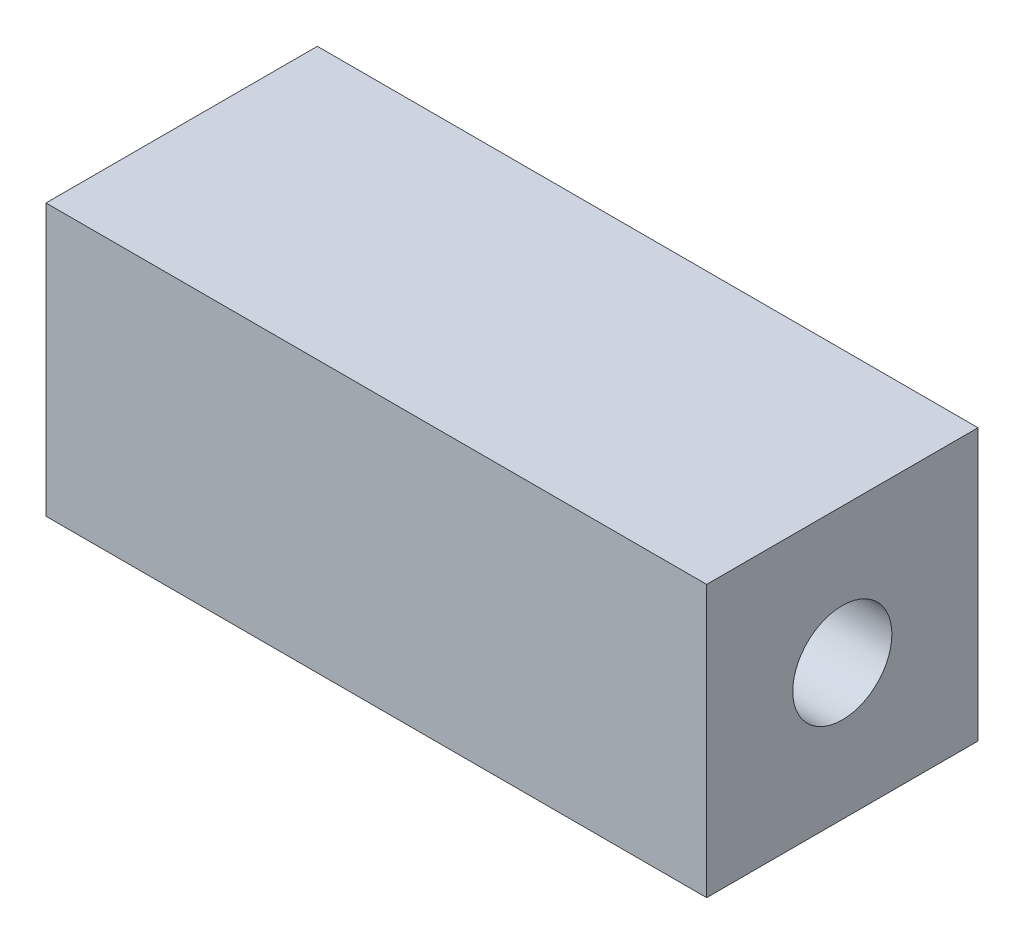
ISO-10303-21;
HEADER;
FILE_DESCRIPTION(('STEP AP214'),'2;1');
FILE_NAME('part.step','',(''),(''),'','','');
FILE_SCHEMA(('AUTOMOTIVE_DESIGN { 1 0 10303 214 1 1 1 1 }'));
ENDSEC;
DATA;
#1=APPLICATION_CONTEXT('core data for automotive mechanical design processes');
#2=APPLICATION_PROTOCOL_DEFINITION('international standard','automotive_design',2000,#1);
#3=PRODUCT_CONTEXT('',#1,'mechanical');
#4=PRODUCT('Part','Part','',(#3));
#5=PRODUCT_RELATED_PRODUCT_CATEGORY('part','',(#4));
#6=PRODUCT_DEFINITION_FORMATION('','',#4);
#7=PRODUCT_DEFINITION_CONTEXT('part definition',#1,'design');
#8=PRODUCT_DEFINITION('design','',#6,#7);
#9=PRODUCT_DEFINITION_SHAPE('','',#8);
#10=(LENGTH_UNIT() NAMED_UNIT(*) SI_UNIT(.MILLI.,.METRE.));
#11=(NAMED_UNIT(*) PLANE_ANGLE_UNIT() SI_UNIT($,.RADIAN.));
#12=(NAMED_UNIT(*) SI_UNIT($,.STERADIAN.) SOLID_ANGLE_UNIT());
#13=UNCERTAINTY_MEASURE_WITH_UNIT(LENGTH_MEASURE(1.E-05),#10,'distance_accuracy_value','');
#14=(GEOMETRIC_REPRESENTATION_CONTEXT(3) GLOBAL_UNCERTAINTY_ASSIGNED_CONTEXT((#13)) GLOBAL_UNIT_ASSIGNED_CONTEXT((#10,
#11,#12)) REPRESENTATION_CONTEXT('',''));
#15=CARTESIAN_POINT('',(0.,0.,0.));
#16=DIRECTION('',(0.,0.,1.));
#17=DIRECTION('',(1.,0.,0.));
#18=AXIS2_PLACEMENT_3D('',#15,#16,#17);
#19=CARTESIAN_POINT('',(0.,0.,0.));
#20=DIRECTION('',(1.,0.,0.));
#21=DIRECTION('',(0.,0.,-1.));
#22=AXIS2_PLACEMENT_3D('',#19,#20,#21);
#23=PLANE('',#22);
#24=DIRECTION('',(0.,-1.,0.));
#25=VECTOR('',#24,1.);
#26=CARTESIAN_POINT('',(0.,4.68518518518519,11.9614197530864));
#27=LINE('',#26,#25);
#28=CARTESIAN_POINT('',(0.,4.68518518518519,11.9614197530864));
#29=VERTEX_POINT('',#28);
#30=CARTESIAN_POINT('',(0.,-6.81481481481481,11.9614197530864));
#31=VERTEX_POINT('',#30);
#32=EDGE_CURVE('E180',#29,#31,#27,.T.);
#33=ORIENTED_EDGE('',*,*,#32,.F.);
#34=DIRECTION('',(0.,0.,1.));
#35=VECTOR('',#34,1.);
#36=CARTESIAN_POINT('',(0.,4.68518518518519,11.9614197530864));
#37=LINE('',#36,#35);
#38=CARTESIAN_POINT('',(0.,4.68518518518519,0.461419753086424));
#39=VERTEX_POINT('',#38);
#40=EDGE_CURVE('E80',#39,#29,#37,.T.);
#41=ORIENTED_EDGE('',*,*,#40,.F.);
#42=DIRECTION('',(0.,1.,0.));
#43=VECTOR('',#42,1.);
#44=CARTESIAN_POINT('',(0.,4.68518518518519,0.461419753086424));
#45=LINE('',#44,#43);
#46=CARTESIAN_POINT('',(0.,-6.81481481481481,0.461419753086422));
#47=VERTEX_POINT('',#46);
#48=EDGE_CURVE('E192',#47,#39,#45,.T.);
#49=ORIENTED_EDGE('',*,*,#48,.F.);
#50=DIRECTION('',(0.,0.,-1.));
#51=VECTOR('',#50,1.);
#52=CARTESIAN_POINT('',(0.,-6.81481481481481,11.9614197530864));
#53=LINE('',#52,#51);
#54=EDGE_CURVE('E190',#31,#47,#53,.T.);
#55=ORIENTED_EDGE('',*,*,#54,.F.);
#56=EDGE_LOOP('',(#33,#41,#49,#55));
#57=FACE_BOUND('',#56,.T.);
#58=DIRECTION('',(0.,0.396504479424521,0.918032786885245));
#59=VECTOR('',#58,1.);
#60=CARTESIAN_POINT('',(0.,0.0193533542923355,-0.00835884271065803));
#61=LINE('',#60,#59);
#62=CARTESIAN_POINT('',(0.,1.21068435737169,2.74994775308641));
#63=VERTEX_POINT('',#62);
#64=CARTESIAN_POINT('',(0.,2.7057171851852,6.21141975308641));
#65=VERTEX_POINT('',#64);
#66=EDGE_CURVE('E50',#63,#65,#61,.T.);
#67=ORIENTED_EDGE('',*,*,#66,.T.);
#68=DIRECTION('',(0.,-0.396504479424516,0.918032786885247));
#69=VECTOR('',#68,1.);
#70=CARTESIAN_POINT('',(0.,4.54131802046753,1.96142552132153));
#71=LINE('',#70,#69);
#72=CARTESIAN_POINT('',(0.,1.21068435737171,9.67289175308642));
#73=VERTEX_POINT('',#72);
#74=EDGE_CURVE('E165',#65,#73,#71,.T.);
#75=ORIENTED_EDGE('',*,*,#74,.T.);
#76=DIRECTION('',(0.,-1.,0.));
#77=VECTOR('',#76,1.);
#78=CARTESIAN_POINT('',(0.,0.,9.67289175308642));
#79=LINE('',#78,#77);
#80=CARTESIAN_POINT('',(0.,-3.34031398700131,9.67289175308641));
#81=VERTEX_POINT('',#80);
#82=EDGE_CURVE('E162',#73,#81,#79,.T.);
#83=ORIENTED_EDGE('',*,*,#82,.T.);
#84=DIRECTION('',(0.,0.396504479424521,0.918032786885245));
#85=VECTOR('',#84,1.);
#86=CARTESIAN_POINT('',(0.,-6.33613621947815,2.73661946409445));
#87=LINE('',#86,#85);
#88=CARTESIAN_POINT('',(0.,-4.83534681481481,6.21141975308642));
#89=VERTEX_POINT('',#88);
#90=EDGE_CURVE('E159',#89,#81,#87,.T.);
#91=ORIENTED_EDGE('',*,*,#90,.F.);
#92=DIRECTION('',(0.,-0.396504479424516,0.918032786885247));
#93=VECTOR('',#92,1.);
#94=CARTESIAN_POINT('',(0.,-1.81417155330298,-0.783552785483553));
#95=LINE('',#94,#93);
#96=CARTESIAN_POINT('',(0.,-3.34031398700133,2.7499477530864));
#97=VERTEX_POINT('',#96);
#98=EDGE_CURVE('E156',#97,#89,#95,.T.);
#99=ORIENTED_EDGE('',*,*,#98,.F.);
#100=DIRECTION('',(0.,-1.,0.));
#101=VECTOR('',#100,1.);
#102=CARTESIAN_POINT('',(0.,0.,2.74994775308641));
#103=LINE('',#102,#101);
#104=EDGE_CURVE('E154',#63,#97,#103,.T.);
#105=ORIENTED_EDGE('',*,*,#104,.F.);
#106=EDGE_LOOP('',(#67,#75,#83,#91,#99,#105));
#107=FACE_BOUND('',#106,.T.);
#108=ADVANCED_FACE('F35',(#57,#107),#23,.F.);
#109=CARTESIAN_POINT('',(28.,-1.06481481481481,6.21141975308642));
#110=DIRECTION('',(-1.,0.,0.));
#111=DIRECTION('',(0.,0.,1.));
#112=AXIS2_PLACEMENT_3D('',#109,#110,#111);
#113=CYLINDRICAL_SURFACE('',#112,2.1);
#114=CARTESIAN_POINT('',(28.,-1.06481481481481,6.21141975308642));
#115=DIRECTION('',(1.,0.,0.));
#116=DIRECTION('',(0.,0.,-1.));
#117=AXIS2_PLACEMENT_3D('',#114,#115,#116);
#118=CIRCLE('',#117,2.1);
#119=CARTESIAN_POINT('',(28.,-1.06481481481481,4.11141975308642));
#120=VERTEX_POINT('',#119);
#121=EDGE_CURVE('E170',#120,#120,#118,.T.);
#122=ORIENTED_EDGE('',*,*,#121,.T.);
#123=EDGE_LOOP('',(#122));
#124=FACE_BOUND('',#123,.T.);
#125=CARTESIAN_POINT('',(3.5,-1.06481481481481,6.21141975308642));
#126=DIRECTION('',(-1.,0.,0.));
#127=DIRECTION('',(0.,0.,1.));
#128=AXIS2_PLACEMENT_3D('',#125,#126,#127);
#129=CIRCLE('',#128,2.1);
#130=CARTESIAN_POINT('',(3.5,-1.06481481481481,8.31141975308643));
#131=VERTEX_POINT('',#130);
#132=EDGE_CURVE('E138',#131,#131,#129,.F.);
#133=ORIENTED_EDGE('',*,*,#132,.F.);
#134=EDGE_LOOP('',(#133));
#135=FACE_BOUND('',#134,.T.);
#136=ADVANCED_FACE('F222',(#124,#135),#113,.F.);
#137=CARTESIAN_POINT('',(28.,0.,0.));
#138=DIRECTION('',(1.,0.,0.));
#139=DIRECTION('',(0.,0.,-1.));
#140=AXIS2_PLACEMENT_3D('',#137,#138,#139);
#141=PLANE('',#140);
#142=DIRECTION('',(0.,-1.,0.));
#143=VECTOR('',#142,1.);
#144=CARTESIAN_POINT('',(28.,4.68518518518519,11.9614197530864));
#145=LINE('',#144,#143);
#146=CARTESIAN_POINT('',(28.,4.68518518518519,11.9614197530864));
#147=VERTEX_POINT('',#146);
#148=CARTESIAN_POINT('',(28.,-6.81481481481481,11.9614197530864));
#149=VERTEX_POINT('',#148);
#150=EDGE_CURVE('E181',#147,#149,#145,.T.);
#151=ORIENTED_EDGE('',*,*,#150,.T.);
#152=DIRECTION('',(0.,0.,-1.));
#153=VECTOR('',#152,1.);
#154=CARTESIAN_POINT('',(28.,-6.81481481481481,11.9614197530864));
#155=LINE('',#154,#153);
#156=CARTESIAN_POINT('',(28.,-6.81481481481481,0.461419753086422));
#157=VERTEX_POINT('',#156);
#158=EDGE_CURVE('E87',#149,#157,#155,.T.);
#159=ORIENTED_EDGE('',*,*,#158,.T.);
#160=DIRECTION('',(0.,1.,0.));
#161=VECTOR('',#160,1.);
#162=CARTESIAN_POINT('',(28.,4.68518518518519,0.461419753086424));
#163=LINE('',#162,#161);
#164=CARTESIAN_POINT('',(28.,4.68518518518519,0.461419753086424));
#165=VERTEX_POINT('',#164);
#166=EDGE_CURVE('E184',#157,#165,#163,.T.);
#167=ORIENTED_EDGE('',*,*,#166,.T.);
#168=DIRECTION('',(0.,0.,1.));
#169=VECTOR('',#168,1.);
#170=CARTESIAN_POINT('',(28.,4.68518518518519,11.9614197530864));
#171=LINE('',#170,#169);
#172=EDGE_CURVE('E59',#165,#147,#171,.T.);
#173=ORIENTED_EDGE('',*,*,#172,.T.);
#174=EDGE_LOOP('',(#151,#159,#167,#173));
#175=FACE_BOUND('',#174,.T.);
#176=ORIENTED_EDGE('',*,*,#121,.F.);
#177=EDGE_LOOP('',(#176));
#178=FACE_BOUND('',#177,.T.);
#179=ADVANCED_FACE('F226',(#175,#178),#141,.T.);
#180=CARTESIAN_POINT('',(28.,4.68518518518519,11.9614197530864));
#181=DIRECTION('',(0.,0.,-1.));
#182=DIRECTION('',(-1.,0.,0.));
#183=AXIS2_PLACEMENT_3D('',#180,#181,#182);
#184=PLANE('',#183);
#185=ORIENTED_EDGE('',*,*,#32,.T.);
#186=DIRECTION('',(-1.,0.,0.));
#187=VECTOR('',#186,1.);
#188=CARTESIAN_POINT('',(28.,-6.81481481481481,11.9614197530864));
#189=LINE('',#188,#187);
#190=EDGE_CURVE('E11',#149,#31,#189,.T.);
#191=ORIENTED_EDGE('',*,*,#190,.F.);
#192=ORIENTED_EDGE('',*,*,#150,.F.);
#193=DIRECTION('',(-1.,0.,0.));
#194=VECTOR('',#193,1.);
#195=CARTESIAN_POINT('',(28.,4.68518518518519,11.9614197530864));
#196=LINE('',#195,#194);
#197=EDGE_CURVE('E187',#147,#29,#196,.T.);
#198=ORIENTED_EDGE('',*,*,#197,.T.);
#199=EDGE_LOOP('',(#185,#191,#192,#198));
#200=FACE_BOUND('',#199,.T.);
#201=ADVANCED_FACE('F37',(#200),#184,.F.);
#202=CARTESIAN_POINT('',(28.,-6.81481481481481,11.9614197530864));
#203=DIRECTION('',(0.,1.,0.));
#204=DIRECTION('',(0.,0.,1.));
#205=AXIS2_PLACEMENT_3D('',#202,#203,#204);
#206=PLANE('',#205);
#207=ORIENTED_EDGE('',*,*,#54,.T.);
#208=DIRECTION('',(-1.,0.,0.));
#209=VECTOR('',#208,1.);
#210=CARTESIAN_POINT('',(28.,-6.81481481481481,0.461419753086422));
#211=LINE('',#210,#209);
#212=EDGE_CURVE('E43',#157,#47,#211,.T.);
#213=ORIENTED_EDGE('',*,*,#212,.F.);
#214=ORIENTED_EDGE('',*,*,#158,.F.);
#215=ORIENTED_EDGE('',*,*,#190,.T.);
#216=EDGE_LOOP('',(#207,#213,#214,#215));
#217=FACE_BOUND('',#216,.T.);
#218=ADVANCED_FACE('F218',(#217),#206,.F.);
#219=CARTESIAN_POINT('',(28.,4.68518518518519,0.461419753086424));
#220=DIRECTION('',(0.,0.,1.));
#221=DIRECTION('',(0.,-1.,0.));
#222=AXIS2_PLACEMENT_3D('',#219,#220,#221);
#223=PLANE('',#222);
#224=ORIENTED_EDGE('',*,*,#48,.T.);
#225=DIRECTION('',(-1.,0.,0.));
#226=VECTOR('',#225,1.);
#227=CARTESIAN_POINT('',(28.,4.68518518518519,0.461419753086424));
#228=LINE('',#227,#226);
#229=EDGE_CURVE('E196',#165,#39,#228,.T.);
#230=ORIENTED_EDGE('',*,*,#229,.F.);
#231=ORIENTED_EDGE('',*,*,#166,.F.);
#232=ORIENTED_EDGE('',*,*,#212,.T.);
#233=EDGE_LOOP('',(#224,#230,#231,#232));
#234=FACE_BOUND('',#233,.T.);
#235=ADVANCED_FACE('F201',(#234),#223,.F.);
#236=CARTESIAN_POINT('',(28.,4.68518518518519,11.9614197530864));
#237=DIRECTION('',(0.,-1.,0.));
#238=DIRECTION('',(0.,0.,-1.));
#239=AXIS2_PLACEMENT_3D('',#236,#237,#238);
#240=PLANE('',#239);
#241=ORIENTED_EDGE('',*,*,#40,.T.);
#242=ORIENTED_EDGE('',*,*,#197,.F.);
#243=ORIENTED_EDGE('',*,*,#172,.F.);
#244=ORIENTED_EDGE('',*,*,#229,.T.);
#245=EDGE_LOOP('',(#241,#242,#243,#244));
#246=FACE_BOUND('',#245,.T.);
#247=ADVANCED_FACE('F209',(#246),#240,.F.);
#248=CARTESIAN_POINT('',(3.5,0.0193533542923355,-0.00835884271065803));
#249=DIRECTION('',(0.,-0.918032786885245,0.396504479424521));
#250=DIRECTION('',(0.,-0.396504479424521,-0.918032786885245));
#251=AXIS2_PLACEMENT_3D('',#248,#249,#250);
#252=PLANE('',#251);
#253=ORIENTED_EDGE('',*,*,#66,.F.);
#254=DIRECTION('',(-1.,0.,0.));
#255=VECTOR('',#254,1.);
#256=CARTESIAN_POINT('',(3.5,1.21068435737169,2.74994775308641));
#257=LINE('',#256,#255);
#258=CARTESIAN_POINT('',(3.5,1.21068435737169,2.74994775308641));
#259=VERTEX_POINT('',#258);
#260=EDGE_CURVE('E120',#259,#63,#257,.T.);
#261=ORIENTED_EDGE('',*,*,#260,.F.);
#262=DIRECTION('',(0.,0.396504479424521,0.918032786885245));
#263=VECTOR('',#262,1.);
#264=CARTESIAN_POINT('',(3.5,0.0193533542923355,-0.00835884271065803));
#265=LINE('',#264,#263);
#266=CARTESIAN_POINT('',(3.5,2.7057171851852,6.21141975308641));
#267=VERTEX_POINT('',#266);
#268=EDGE_CURVE('E123',#259,#267,#265,.T.);
#269=ORIENTED_EDGE('',*,*,#268,.T.);
#270=DIRECTION('',(-1.,0.,0.));
#271=VECTOR('',#270,1.);
#272=CARTESIAN_POINT('',(3.5,2.7057171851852,6.21141975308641));
#273=LINE('',#272,#271);
#274=EDGE_CURVE('E168',#267,#65,#273,.T.);
#275=ORIENTED_EDGE('',*,*,#274,.T.);
#276=EDGE_LOOP('',(#253,#261,#269,#275));
#277=FACE_BOUND('',#276,.T.);
#278=ADVANCED_FACE('F122',(#277),#252,.T.);
#279=CARTESIAN_POINT('',(3.5,4.54131802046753,1.96142552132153));
#280=DIRECTION('',(0.,-0.918032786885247,-0.396504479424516));
#281=DIRECTION('',(0.,0.396504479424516,-0.918032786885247));
#282=AXIS2_PLACEMENT_3D('',#279,#280,#281);
#283=PLANE('',#282);
#284=ORIENTED_EDGE('',*,*,#74,.F.);
#285=ORIENTED_EDGE('',*,*,#274,.F.);
#286=DIRECTION('',(0.,-0.396504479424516,0.918032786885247));
#287=VECTOR('',#286,1.);
#288=CARTESIAN_POINT('',(3.5,4.54131802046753,1.96142552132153));
#289=LINE('',#288,#287);
#290=CARTESIAN_POINT('',(3.5,1.21068435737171,9.67289175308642));
#291=VERTEX_POINT('',#290);
#292=EDGE_CURVE('E130',#267,#291,#289,.T.);
#293=ORIENTED_EDGE('',*,*,#292,.T.);
#294=DIRECTION('',(-1.,0.,0.));
#295=VECTOR('',#294,1.);
#296=CARTESIAN_POINT('',(3.5,1.21068435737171,9.67289175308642));
#297=LINE('',#296,#295);
#298=EDGE_CURVE('E171',#291,#73,#297,.T.);
#299=ORIENTED_EDGE('',*,*,#298,.T.);
#300=EDGE_LOOP('',(#284,#285,#293,#299));
#301=FACE_BOUND('',#300,.T.);
#302=ADVANCED_FACE('F216',(#301),#283,.T.);
#303=CARTESIAN_POINT('',(3.5,0.,9.67289175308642));
#304=DIRECTION('',(0.,0.,-1.));
#305=DIRECTION('',(0.,1.,0.));
#306=AXIS2_PLACEMENT_3D('',#303,#304,#305);
#307=PLANE('',#306);
#308=ORIENTED_EDGE('',*,*,#82,.F.);
#309=ORIENTED_EDGE('',*,*,#298,.F.);
#310=DIRECTION('',(0.,-1.,0.));
#311=VECTOR('',#310,1.);
#312=CARTESIAN_POINT('',(3.5,0.,9.67289175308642));
#313=LINE('',#312,#311);
#314=CARTESIAN_POINT('',(3.5,-3.34031398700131,9.67289175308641));
#315=VERTEX_POINT('',#314);
#316=EDGE_CURVE('E150',#291,#315,#313,.T.);
#317=ORIENTED_EDGE('',*,*,#316,.T.);
#318=DIRECTION('',(-1.,0.,0.));
#319=VECTOR('',#318,1.);
#320=CARTESIAN_POINT('',(3.5,-3.34031398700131,9.67289175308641));
#321=LINE('',#320,#319);
#322=EDGE_CURVE('E173',#315,#81,#321,.T.);
#323=ORIENTED_EDGE('',*,*,#322,.T.);
#324=EDGE_LOOP('',(#308,#309,#317,#323));
#325=FACE_BOUND('',#324,.T.);
#326=ADVANCED_FACE('F241',(#325),#307,.T.);
#327=CARTESIAN_POINT('',(3.5,-6.33613621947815,2.73661946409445));
#328=DIRECTION('',(0.,-0.918032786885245,0.396504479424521));
#329=DIRECTION('',(0.,-0.396504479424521,-0.918032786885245));
#330=AXIS2_PLACEMENT_3D('',#327,#328,#329);
#331=PLANE('',#330);
#332=ORIENTED_EDGE('',*,*,#90,.T.);
#333=ORIENTED_EDGE('',*,*,#322,.F.);
#334=DIRECTION('',(0.,0.396504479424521,0.918032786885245));
#335=VECTOR('',#334,1.);
#336=CARTESIAN_POINT('',(3.5,-6.33613621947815,2.73661946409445));
#337=LINE('',#336,#335);
#338=CARTESIAN_POINT('',(3.5,-4.83534681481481,6.21141975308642));
#339=VERTEX_POINT('',#338);
#340=EDGE_CURVE('E144',#339,#315,#337,.T.);
#341=ORIENTED_EDGE('',*,*,#340,.F.);
#342=DIRECTION('',(-1.,0.,0.));
#343=VECTOR('',#342,1.);
#344=CARTESIAN_POINT('',(3.5,-4.83534681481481,6.21141975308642));
#345=LINE('',#344,#343);
#346=EDGE_CURVE('E175',#339,#89,#345,.T.);
#347=ORIENTED_EDGE('',*,*,#346,.T.);
#348=EDGE_LOOP('',(#332,#333,#341,#347));
#349=FACE_BOUND('',#348,.T.);
#350=ADVANCED_FACE('F237',(#349),#331,.F.);
#351=CARTESIAN_POINT('',(3.5,-1.81417155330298,-0.783552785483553));
#352=DIRECTION('',(0.,-0.918032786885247,-0.396504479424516));
#353=DIRECTION('',(0.,0.396504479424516,-0.918032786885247));
#354=AXIS2_PLACEMENT_3D('',#351,#352,#353);
#355=PLANE('',#354);
#356=ORIENTED_EDGE('',*,*,#98,.T.);
#357=ORIENTED_EDGE('',*,*,#346,.F.);
#358=DIRECTION('',(0.,-0.396504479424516,0.918032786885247));
#359=VECTOR('',#358,1.);
#360=CARTESIAN_POINT('',(3.5,-1.81417155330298,-0.783552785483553));
#361=LINE('',#360,#359);
#362=CARTESIAN_POINT('',(3.5,-3.34031398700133,2.7499477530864));
#363=VERTEX_POINT('',#362);
#364=EDGE_CURVE('E142',#363,#339,#361,.T.);
#365=ORIENTED_EDGE('',*,*,#364,.F.);
#366=DIRECTION('',(-1.,0.,0.));
#367=VECTOR('',#366,1.);
#368=CARTESIAN_POINT('',(3.5,-3.34031398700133,2.7499477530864));
#369=LINE('',#368,#367);
#370=EDGE_CURVE('E129',#363,#97,#369,.T.);
#371=ORIENTED_EDGE('',*,*,#370,.T.);
#372=EDGE_LOOP('',(#356,#357,#365,#371));
#373=FACE_BOUND('',#372,.T.);
#374=ADVANCED_FACE('F234',(#373),#355,.F.);
#375=CARTESIAN_POINT('',(3.5,0.,2.74994775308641));
#376=DIRECTION('',(0.,0.,-1.));
#377=DIRECTION('',(0.,1.,0.));
#378=AXIS2_PLACEMENT_3D('',#375,#376,#377);
#379=PLANE('',#378);
#380=ORIENTED_EDGE('',*,*,#104,.T.);
#381=ORIENTED_EDGE('',*,*,#370,.F.);
#382=DIRECTION('',(0.,-1.,0.));
#383=VECTOR('',#382,1.);
#384=CARTESIAN_POINT('',(3.5,0.,2.74994775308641));
#385=LINE('',#384,#383);
#386=EDGE_CURVE('E136',#259,#363,#385,.T.);
#387=ORIENTED_EDGE('',*,*,#386,.F.);
#388=ORIENTED_EDGE('',*,*,#260,.T.);
#389=EDGE_LOOP('',(#380,#381,#387,#388));
#390=FACE_BOUND('',#389,.T.);
#391=ADVANCED_FACE('F140',(#390),#379,.F.);
#392=CARTESIAN_POINT('',(3.5,0.,0.));
#393=DIRECTION('',(-1.,0.,0.));
#394=DIRECTION('',(0.,0.,1.));
#395=AXIS2_PLACEMENT_3D('',#392,#393,#394);
#396=PLANE('',#395);
#397=ORIENTED_EDGE('',*,*,#132,.T.);
#398=EDGE_LOOP('',(#397));
#399=FACE_BOUND('',#398,.T.);
#400=ORIENTED_EDGE('',*,*,#268,.F.);
#401=ORIENTED_EDGE('',*,*,#386,.T.);
#402=ORIENTED_EDGE('',*,*,#364,.T.);
#403=ORIENTED_EDGE('',*,*,#340,.T.);
#404=ORIENTED_EDGE('',*,*,#316,.F.);
#405=ORIENTED_EDGE('',*,*,#292,.F.);
#406=EDGE_LOOP('',(#400,#401,#402,#403,#404,#405));
#407=FACE_BOUND('',#406,.T.);
#408=ADVANCED_FACE('F134',(#399,#407),#396,.T.);
#409=CLOSED_SHELL('',(#108,#136,#179,#201,#218,#235,#247,#278,#302,#326,#350,#374,#391,#408));
#410=MANIFOLD_SOLID_BREP('B2',#409);
#411=ADVANCED_BREP_SHAPE_REPRESENTATION('',(#18,#410),#14);
#412=SHAPE_DEFINITION_REPRESENTATION(#9,#411);
ENDSEC;
END-ISO-10303-21;
